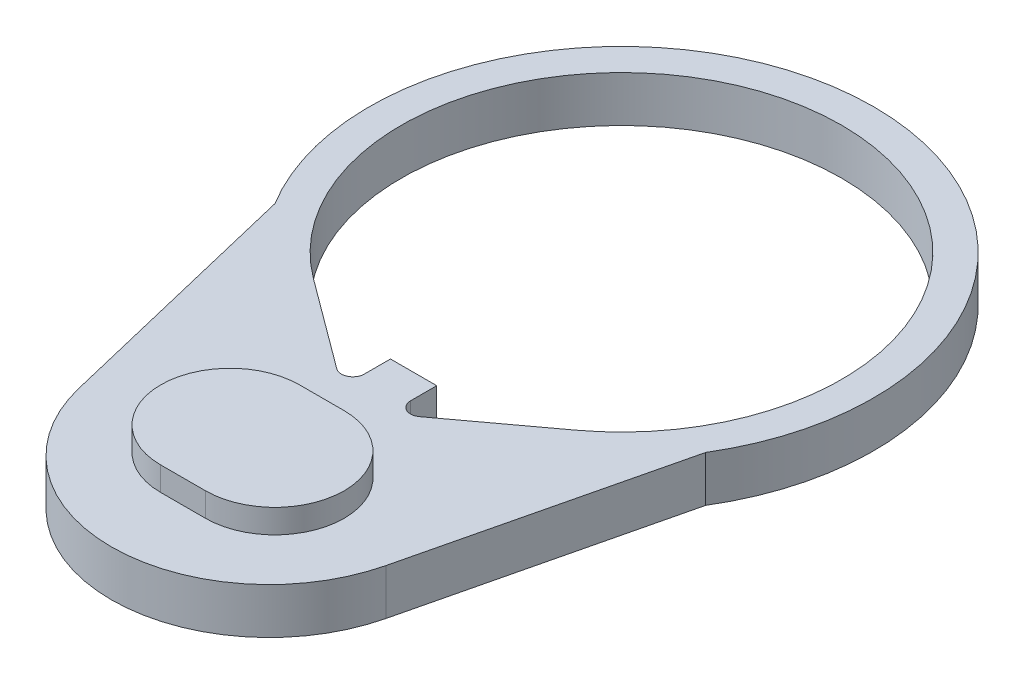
from build123d import *

# Parameters (mm, degrees)
BOSS_EXTRUDE1_DEPTH = 3.1496
BOSS_EXTRUDE2_DEPTH = 1.6383
CUT_EXTRUDE1_DEPTH  = 1.6002


with BuildPart() as part:
    # Sketch1 → Boss-Extrude1 (new body)
    with BuildSketch(Plane(origin=(0, 0, 0), x_dir=(1, 0, 0), z_dir=(0, 1, 0))):
        with BuildLine():
            Line((14.789629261, -9.004334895), (10.537445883, -26.71595334))
            ThreePointArc((10.537445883, -26.71595334), (0, -35.023005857), (-10.537445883, -26.71595334))
            Line((-10.537445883, -26.71595334), (-14.789629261, -9.004334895))
            ThreePointArc((-14.789629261, -9.004334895), (0, 17.31505647), (14.789629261, -9.004334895))
        make_face()
        with BuildLine():
            Line((-2.843263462, -16.701109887), (-8.991662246, -12.151534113))
            ThreePointArc((-8.991662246, -12.151534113), (0, 15.116539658), (8.991662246, -12.151534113))
            Line((8.991662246, -12.151534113), (2.843263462, -16.701109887))
            ThreePointArc((2.843263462, -16.701109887), (2.020492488, -16.771284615), (1.5875, -16.068152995))
            Line((1.5875, -16.068152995), (1.5875, -14.271205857))
            Line((1.5875, -14.271205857), (-1.5875, -14.271205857))
            Line((-1.5875, -14.271205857), (-1.5875, -16.068152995))
            ThreePointArc((-1.5875, -16.068152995), (-2.020492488, -16.771284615), (-2.843263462, -16.701109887))
        make_face(mode=Mode.SUBTRACT)
    extrude(amount=BOSS_EXTRUDE1_DEPTH)

    # Sketch2 → Boss-Extrude2 (add)
    with BuildSketch(Plane(origin=(0, 3.1496, 0), x_dir=(1, 0, 0), z_dir=(0, 1, 0))):
        with BuildLine():
            Line((-1.5367, -20.570405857), (1.5367, -20.570405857))
            ThreePointArc((1.5367, -20.570405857), (6.2992, -25.332905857), (1.5367, -30.095405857))
            Line((1.5367, -30.095405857), (-1.5367, -30.095405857))
            ThreePointArc((-1.5367, -30.095405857), (-6.2992, -25.332905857), (-1.5367, -20.570405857))
        make_face()
    extrude(amount=BOSS_EXTRUDE2_DEPTH)

    # Sketch3 → Cut-Extrude1 (cut)
    with BuildSketch(Plane.XZ):
        with BuildLine():
            Line((-1.5367, 30.222405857), (1.5367, 30.222405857))
            ThreePointArc((1.5367, 30.222405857), (6.4262, 25.332905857), (1.5367, 20.443405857))
            Line((1.5367, 20.443405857), (-1.5367, 20.443405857))
            ThreePointArc((-1.5367, 20.443405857), (-6.4262, 25.332905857), (-1.5367, 30.222405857))
        make_face()
    extrude(amount=-CUT_EXTRUDE1_DEPTH, mode=Mode.SUBTRACT)


solid = part.part
